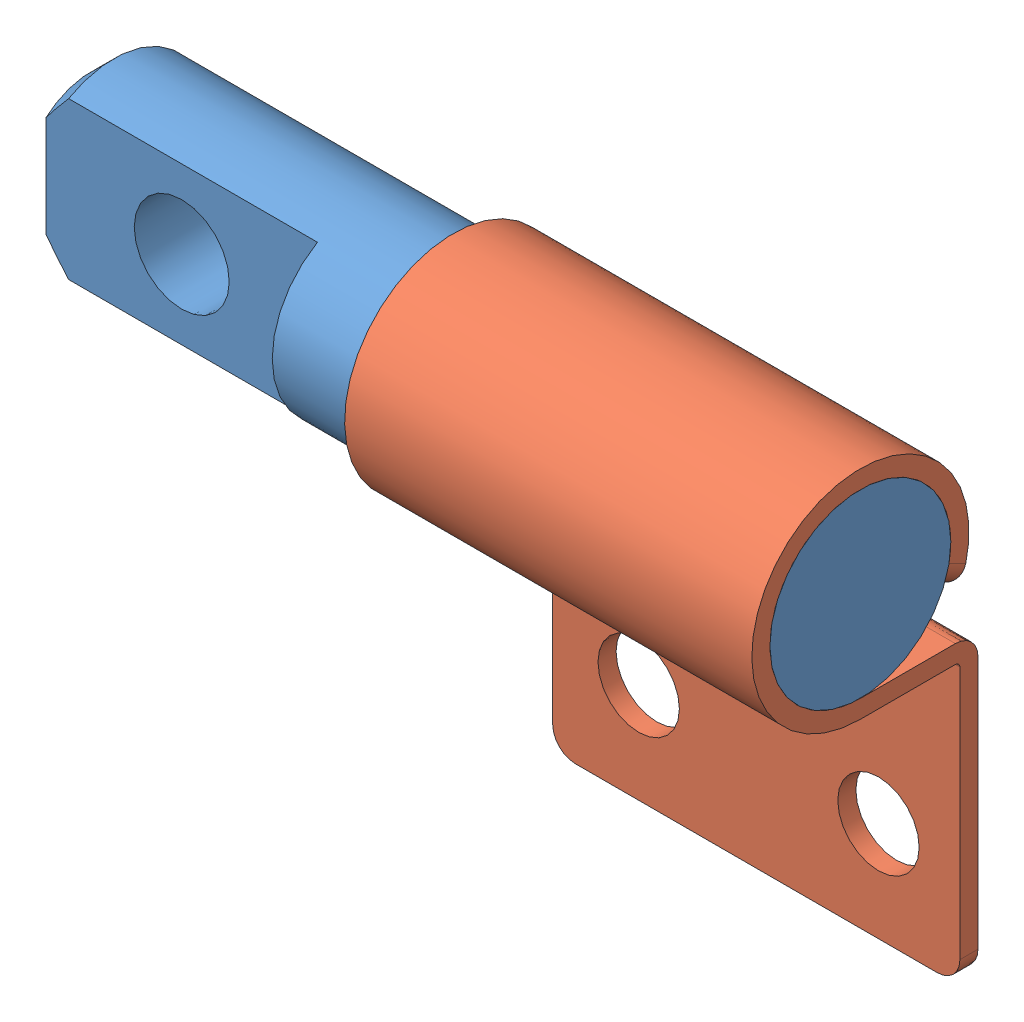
SolidWorks assembly ST010A0.SLDASM, configuration Default (file format 7000). Lengths in mm.
Overall size (17.03 11 5).
2 component instances, 2 part files, 6 mates.
Components (placement in the parent):
- ST010-25A SHAFT-1: ST010-25A SHAFT.SLDPRT [ST010] at (-19.5077 28.5053 -14.6129) size (17 4 4)
- ST010A BRACKET-1: ST010A BRACKET.SLDPRT [Default] at (-11.5077 28.5053 -14.6129) size (9.06 11 5)
Mates (geometry in assembly coordinates):
- Concentric1: concentric aligned: cylinder of ST010-25A SHAFT-1 through (-19.5077 28.5053 -14.6129) axis (-1 0 0) radius 2; cylinder of ST010A BRACKET-1 through (-2.5077 28.5053 -14.6129) axis (-1 0 0) radius 2
- Parallel1: parallel aligned: plane of ST010-25A SHAFT-1 through (-13.5077 30.2374 -13.6129) normal (0 0 1); plane of ST010A BRACKET-1 through (-2.5077 26.0053 -16.8129) normal (0 0 1)
- Coincident2: coincident aligned: plane of ST010-25A SHAFT-1 through (-2.5077 30.5053 -14.6129) normal (1 0 0); plane of ST010A BRACKET-1 through (-2.5077 26.0053 -16.7129) normal (1 0 0)
- Concentric2: concentric aligned: cylinder of ST010-25A SHAFT-1 through (-19.5077 28.5053 -14.6129) axis (-1 0 0) radius 2; cylinder of ST010A BRACKET-1 through (-2.5077 28.5053 -14.6129) axis (-1 0 0) radius 2
- Coincident3: coincident aligned: plane of ST010-25A SHAFT-1 through (-2.5077 30.5053 -14.6129) normal (1 0 0); plane of ST010A BRACKET-1 through (-2.5077 26.0053 -16.7129) normal (1 0 0)
- Parallel2: parallel aligned: plane of ST010-25A SHAFT-1 through (-13.5077 30.2374 -13.6129) normal (0 0 1); plane of ST010A BRACKET-1 through (-2.5077 26.0053 -16.8129) normal (0 0 1)
